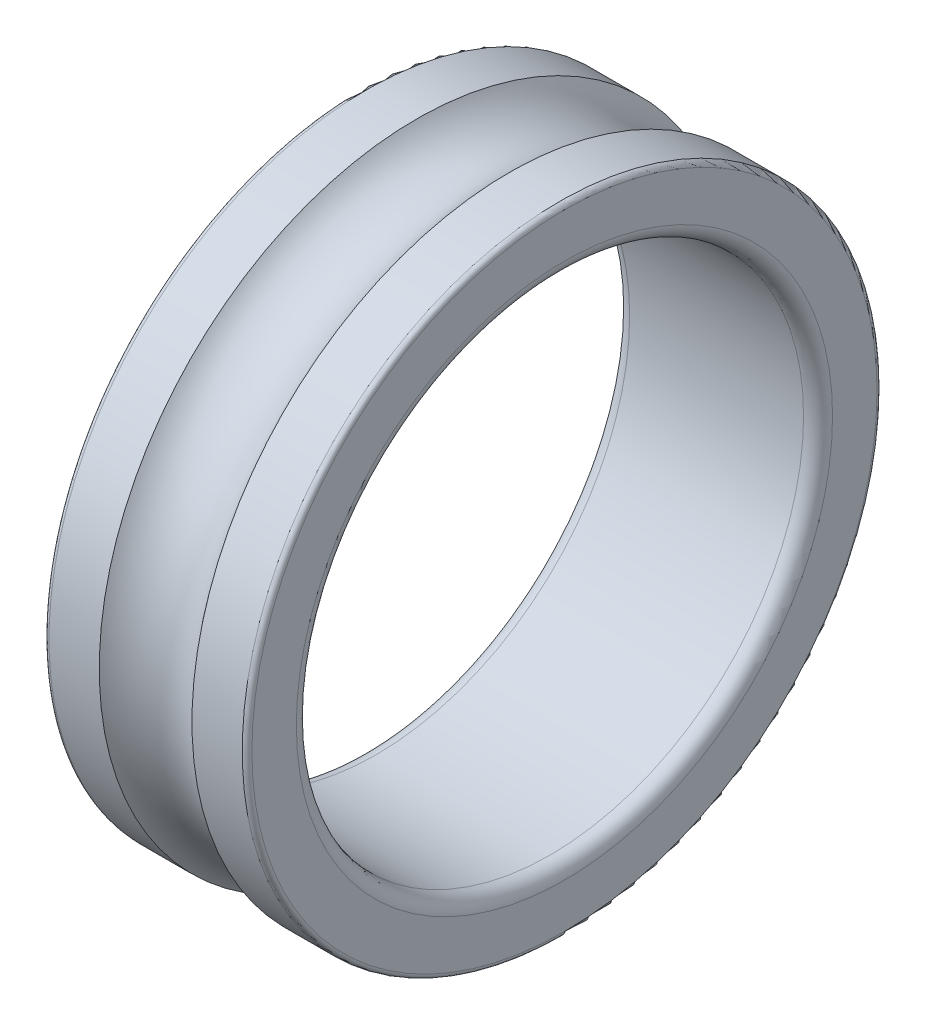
ISO-10303-21;
HEADER;
FILE_DESCRIPTION(('STEP AP214'),'2;1');
FILE_NAME('part.step','',(''),(''),'','','');
FILE_SCHEMA(('AUTOMOTIVE_DESIGN { 1 0 10303 214 1 1 1 1 }'));
ENDSEC;
DATA;
#1=APPLICATION_CONTEXT('core data for automotive mechanical design processes');
#2=APPLICATION_PROTOCOL_DEFINITION('international standard','automotive_design',2000,#1);
#3=PRODUCT_CONTEXT('',#1,'mechanical');
#4=PRODUCT('Part','Part','',(#3));
#5=PRODUCT_RELATED_PRODUCT_CATEGORY('part','',(#4));
#6=PRODUCT_DEFINITION_FORMATION('','',#4);
#7=PRODUCT_DEFINITION_CONTEXT('part definition',#1,'design');
#8=PRODUCT_DEFINITION('design','',#6,#7);
#9=PRODUCT_DEFINITION_SHAPE('','',#8);
#10=(LENGTH_UNIT() NAMED_UNIT(*) SI_UNIT(.MILLI.,.METRE.));
#11=(NAMED_UNIT(*) PLANE_ANGLE_UNIT() SI_UNIT($,.RADIAN.));
#12=(NAMED_UNIT(*) SI_UNIT($,.STERADIAN.) SOLID_ANGLE_UNIT());
#13=UNCERTAINTY_MEASURE_WITH_UNIT(LENGTH_MEASURE(1.E-05),#10,'distance_accuracy_value','');
#14=(GEOMETRIC_REPRESENTATION_CONTEXT(3) GLOBAL_UNCERTAINTY_ASSIGNED_CONTEXT((#13)) GLOBAL_UNIT_ASSIGNED_CONTEXT((#10,
#11,#12)) REPRESENTATION_CONTEXT('',''));
#15=CARTESIAN_POINT('',(0.,0.,0.));
#16=DIRECTION('',(0.,0.,1.));
#17=DIRECTION('',(1.,0.,0.));
#18=AXIS2_PLACEMENT_3D('',#15,#16,#17);
#19=CARTESIAN_POINT('',(0.999999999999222,0.,0.));
#20=DIRECTION('',(1.,0.,0.));
#21=DIRECTION('',(0.,0.,-1.));
#22=AXIS2_PLACEMENT_3D('',#19,#20,#21);
#23=TOROIDAL_SURFACE('',#22,18.4999999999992,0.999999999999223);
#24=CARTESIAN_POINT('',(0.999999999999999,0.,0.));
#25=DIRECTION('',(1.,0.,0.));
#26=DIRECTION('',(0.,0.,-1.));
#27=AXIS2_PLACEMENT_3D('',#24,#25,#26);
#28=CIRCLE('',#27,17.5);
#29=CARTESIAN_POINT('',(0.999999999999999,0.,-17.5));
#30=VERTEX_POINT('',#29);
#31=EDGE_CURVE('E10',#30,#30,#28,.T.);
#32=ORIENTED_EDGE('',*,*,#31,.T.);
#33=EDGE_LOOP('',(#32));
#34=FACE_BOUND('',#33,.T.);
#35=CARTESIAN_POINT('',(0.,0.,0.));
#36=DIRECTION('',(1.,0.,0.));
#37=DIRECTION('',(0.,0.,-1.));
#38=AXIS2_PLACEMENT_3D('',#35,#36,#37);
#39=CIRCLE('',#38,18.5);
#40=CARTESIAN_POINT('',(0.,0.,-18.5));
#41=VERTEX_POINT('',#40);
#42=EDGE_CURVE('E65',#41,#41,#39,.T.);
#43=ORIENTED_EDGE('',*,*,#42,.F.);
#44=EDGE_LOOP('',(#43));
#45=FACE_BOUND('',#44,.T.);
#46=ADVANCED_FACE('F31',(#34,#45),#23,.T.);
#47=CARTESIAN_POINT('',(13.,0.,0.));
#48=DIRECTION('',(1.,0.,0.));
#49=DIRECTION('',(0.,0.,-1.));
#50=AXIS2_PLACEMENT_3D('',#47,#48,#49);
#51=CYLINDRICAL_SURFACE('',#50,17.5);
#52=CARTESIAN_POINT('',(13.,0.,0.));
#53=DIRECTION('',(1.,0.,0.));
#54=DIRECTION('',(0.,0.,-1.));
#55=AXIS2_PLACEMENT_3D('',#52,#53,#54);
#56=CIRCLE('',#55,17.5);
#57=CARTESIAN_POINT('',(13.,0.,-17.5));
#58=VERTEX_POINT('',#57);
#59=EDGE_CURVE('E37',#58,#58,#56,.T.);
#60=ORIENTED_EDGE('',*,*,#59,.T.);
#61=EDGE_LOOP('',(#60));
#62=FACE_BOUND('',#61,.T.);
#63=ORIENTED_EDGE('',*,*,#31,.F.);
#64=EDGE_LOOP('',(#63));
#65=FACE_BOUND('',#64,.T.);
#66=ADVANCED_FACE('F73',(#62,#65),#51,.F.);
#67=CARTESIAN_POINT('',(13.0000000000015,0.,0.));
#68=DIRECTION('',(1.,0.,0.));
#69=DIRECTION('',(0.,0.,-1.));
#70=AXIS2_PLACEMENT_3D('',#67,#68,#69);
#71=TOROIDAL_SURFACE('',#70,18.4999999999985,0.999999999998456);
#72=CARTESIAN_POINT('',(14.,0.,0.));
#73=DIRECTION('',(1.,0.,0.));
#74=DIRECTION('',(0.,0.,-1.));
#75=AXIS2_PLACEMENT_3D('',#72,#73,#74);
#76=CIRCLE('',#75,18.5);
#77=CARTESIAN_POINT('',(14.,0.,-18.5));
#78=VERTEX_POINT('',#77);
#79=EDGE_CURVE('E41',#78,#78,#76,.T.);
#80=ORIENTED_EDGE('',*,*,#79,.T.);
#81=EDGE_LOOP('',(#80));
#82=FACE_BOUND('',#81,.T.);
#83=ORIENTED_EDGE('',*,*,#59,.F.);
#84=EDGE_LOOP('',(#83));
#85=FACE_BOUND('',#84,.T.);
#86=ADVANCED_FACE('F77',(#82,#85),#71,.T.);
#87=CARTESIAN_POINT('',(14.,18.5,0.));
#88=DIRECTION('',(1.,0.,0.));
#89=DIRECTION('',(0.,0.,-1.));
#90=AXIS2_PLACEMENT_3D('',#87,#88,#89);
#91=PLANE('',#90);
#92=CARTESIAN_POINT('',(14.,0.,0.));
#93=DIRECTION('',(1.,0.,0.));
#94=DIRECTION('',(0.,0.,-1.));
#95=AXIS2_PLACEMENT_3D('',#92,#93,#94);
#96=CIRCLE('',#95,21.567);
#97=CARTESIAN_POINT('',(14.,0.,-21.567));
#98=VERTEX_POINT('',#97);
#99=EDGE_CURVE('E45',#98,#98,#96,.T.);
#100=ORIENTED_EDGE('',*,*,#99,.T.);
#101=EDGE_LOOP('',(#100));
#102=FACE_BOUND('',#101,.T.);
#103=ORIENTED_EDGE('',*,*,#79,.F.);
#104=EDGE_LOOP('',(#103));
#105=FACE_BOUND('',#104,.T.);
#106=ADVANCED_FACE('F81',(#102,#105),#91,.T.);
#107=CARTESIAN_POINT('',(13.6669999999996,0.,0.));
#108=DIRECTION('',(1.,0.,0.));
#109=DIRECTION('',(0.,0.,-1.));
#110=AXIS2_PLACEMENT_3D('',#107,#108,#109);
#111=TOROIDAL_SURFACE('',#110,21.5669999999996,0.33300000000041);
#112=CARTESIAN_POINT('',(13.667,0.,0.));
#113=DIRECTION('',(1.,0.,0.));
#114=DIRECTION('',(0.,0.,-1.));
#115=AXIS2_PLACEMENT_3D('',#112,#113,#114);
#116=CIRCLE('',#115,21.9);
#117=CARTESIAN_POINT('',(13.667,0.,-21.9));
#118=VERTEX_POINT('',#117);
#119=EDGE_CURVE('E50',#118,#118,#116,.T.);
#120=ORIENTED_EDGE('',*,*,#119,.T.);
#121=EDGE_LOOP('',(#120));
#122=FACE_BOUND('',#121,.T.);
#123=ORIENTED_EDGE('',*,*,#99,.F.);
#124=EDGE_LOOP('',(#123));
#125=FACE_BOUND('',#124,.T.);
#126=ADVANCED_FACE('F88',(#122,#125),#111,.T.);
#127=CARTESIAN_POINT('',(13.,0.,0.));
#128=DIRECTION('',(1.,0.,0.));
#129=DIRECTION('',(0.,0.,-1.));
#130=AXIS2_PLACEMENT_3D('',#127,#128,#129);
#131=CYLINDRICAL_SURFACE('',#130,21.9);
#132=CARTESIAN_POINT('',(10.198509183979,0.,0.));
#133=DIRECTION('',(1.,0.,0.));
#134=DIRECTION('',(0.,0.,-1.));
#135=AXIS2_PLACEMENT_3D('',#132,#133,#134);
#136=CIRCLE('',#135,21.9);
#137=CARTESIAN_POINT('',(10.198509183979,0.,-21.9));
#138=VERTEX_POINT('',#137);
#139=EDGE_CURVE('E53',#138,#138,#136,.T.);
#140=ORIENTED_EDGE('',*,*,#139,.T.);
#141=EDGE_LOOP('',(#140));
#142=FACE_BOUND('',#141,.T.);
#143=ORIENTED_EDGE('',*,*,#119,.F.);
#144=EDGE_LOOP('',(#143));
#145=FACE_BOUND('',#144,.T.);
#146=ADVANCED_FACE('F92',(#142,#145),#131,.T.);
#147=CARTESIAN_POINT('',(6.99999999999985,0.,0.));
#148=DIRECTION('',(1.,0.,0.));
#149=DIRECTION('',(0.,0.,-1.));
#150=AXIS2_PLACEMENT_3D('',#147,#148,#149);
#151=TOROIDAL_SURFACE('',#150,24.2499999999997,3.96899999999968);
#152=CARTESIAN_POINT('',(3.8014908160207,0.,0.));
#153=DIRECTION('',(1.,0.,0.));
#154=DIRECTION('',(0.,0.,-1.));
#155=AXIS2_PLACEMENT_3D('',#152,#153,#154);
#156=CIRCLE('',#155,21.9);
#157=CARTESIAN_POINT('',(3.8014908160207,0.,-21.9));
#158=VERTEX_POINT('',#157);
#159=EDGE_CURVE('E56',#158,#158,#156,.T.);
#160=ORIENTED_EDGE('',*,*,#159,.T.);
#161=EDGE_LOOP('',(#160));
#162=FACE_BOUND('',#161,.T.);
#163=ORIENTED_EDGE('',*,*,#139,.F.);
#164=EDGE_LOOP('',(#163));
#165=FACE_BOUND('',#164,.T.);
#166=ADVANCED_FACE('F96',(#162,#165),#151,.F.);
#167=CARTESIAN_POINT('',(13.,0.,0.));
#168=DIRECTION('',(1.,0.,0.));
#169=DIRECTION('',(0.,0.,-1.));
#170=AXIS2_PLACEMENT_3D('',#167,#168,#169);
#171=CYLINDRICAL_SURFACE('',#170,21.9);
#172=CARTESIAN_POINT('',(0.333,0.,0.));
#173=DIRECTION('',(1.,0.,0.));
#174=DIRECTION('',(0.,0.,-1.));
#175=AXIS2_PLACEMENT_3D('',#172,#173,#174);
#176=CIRCLE('',#175,21.9);
#177=CARTESIAN_POINT('',(0.333,0.,-21.9));
#178=VERTEX_POINT('',#177);
#179=EDGE_CURVE('E59',#178,#178,#176,.T.);
#180=ORIENTED_EDGE('',*,*,#179,.T.);
#181=EDGE_LOOP('',(#180));
#182=FACE_BOUND('',#181,.T.);
#183=ORIENTED_EDGE('',*,*,#159,.F.);
#184=EDGE_LOOP('',(#183));
#185=FACE_BOUND('',#184,.T.);
#186=ADVANCED_FACE('F100',(#182,#185),#171,.T.);
#187=CARTESIAN_POINT('',(0.333000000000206,0.,0.));
#188=DIRECTION('',(1.,0.,0.));
#189=DIRECTION('',(0.,0.,-1.));
#190=AXIS2_PLACEMENT_3D('',#187,#188,#189);
#191=TOROIDAL_SURFACE('',#190,21.5669999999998,0.333000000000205);
#192=CARTESIAN_POINT('',(0.,0.,0.));
#193=DIRECTION('',(1.,0.,0.));
#194=DIRECTION('',(0.,0.,-1.));
#195=AXIS2_PLACEMENT_3D('',#192,#193,#194);
#196=CIRCLE('',#195,21.567);
#197=CARTESIAN_POINT('',(0.,0.,-21.567));
#198=VERTEX_POINT('',#197);
#199=EDGE_CURVE('E62',#198,#198,#196,.T.);
#200=ORIENTED_EDGE('',*,*,#199,.T.);
#201=EDGE_LOOP('',(#200));
#202=FACE_BOUND('',#201,.T.);
#203=ORIENTED_EDGE('',*,*,#179,.F.);
#204=EDGE_LOOP('',(#203));
#205=FACE_BOUND('',#204,.T.);
#206=ADVANCED_FACE('F104',(#202,#205),#191,.T.);
#207=CARTESIAN_POINT('',(0.,21.567,0.));
#208=DIRECTION('',(-1.,0.,0.));
#209=DIRECTION('',(0.,0.,1.));
#210=AXIS2_PLACEMENT_3D('',#207,#208,#209);
#211=PLANE('',#210);
#212=ORIENTED_EDGE('',*,*,#42,.T.);
#213=EDGE_LOOP('',(#212));
#214=FACE_BOUND('',#213,.T.);
#215=ORIENTED_EDGE('',*,*,#199,.F.);
#216=EDGE_LOOP('',(#215));
#217=FACE_BOUND('',#216,.T.);
#218=ADVANCED_FACE('F69',(#214,#217),#211,.T.);
#219=CLOSED_SHELL('',(#46,#66,#86,#106,#126,#146,#166,#186,#206,#218));
#220=MANIFOLD_SOLID_BREP('B2',#219);
#221=ADVANCED_BREP_SHAPE_REPRESENTATION('',(#18,#220),#14);
#222=SHAPE_DEFINITION_REPRESENTATION(#9,#221);
ENDSEC;
END-ISO-10303-21;
